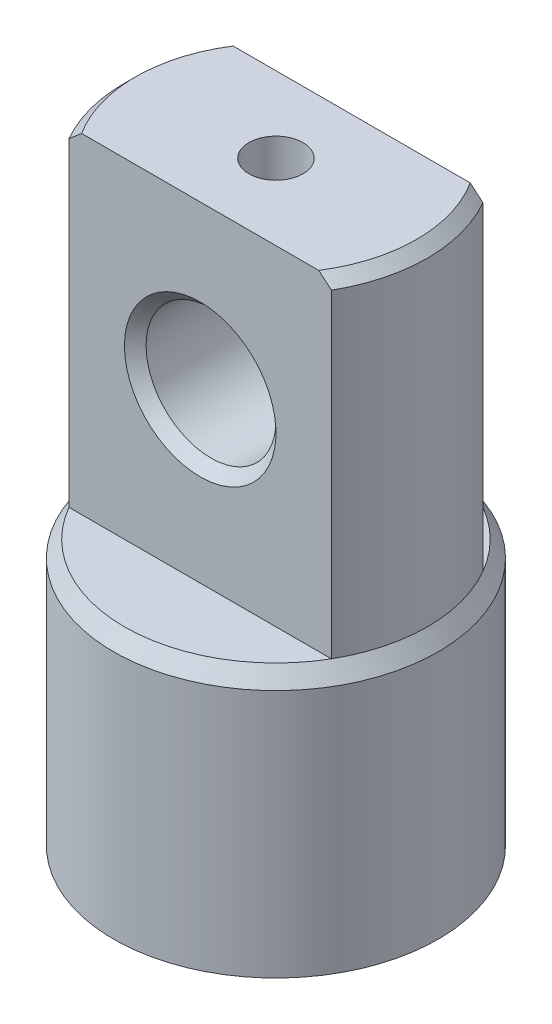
ISO-10303-21;
HEADER;
FILE_DESCRIPTION(('STEP AP214'),'2;1');
FILE_NAME('part.step','',(''),(''),'','','');
FILE_SCHEMA(('AUTOMOTIVE_DESIGN { 1 0 10303 214 1 1 1 1 }'));
ENDSEC;
DATA;
#1=APPLICATION_CONTEXT('core data for automotive mechanical design processes');
#2=APPLICATION_PROTOCOL_DEFINITION('international standard','automotive_design',2000,#1);
#3=PRODUCT_CONTEXT('',#1,'mechanical');
#4=PRODUCT('Part','Part','',(#3));
#5=PRODUCT_RELATED_PRODUCT_CATEGORY('part','',(#4));
#6=PRODUCT_DEFINITION_FORMATION('','',#4);
#7=PRODUCT_DEFINITION_CONTEXT('part definition',#1,'design');
#8=PRODUCT_DEFINITION('design','',#6,#7);
#9=PRODUCT_DEFINITION_SHAPE('','',#8);
#10=(LENGTH_UNIT() NAMED_UNIT(*) SI_UNIT(.MILLI.,.METRE.));
#11=(NAMED_UNIT(*) PLANE_ANGLE_UNIT() SI_UNIT($,.RADIAN.));
#12=(NAMED_UNIT(*) SI_UNIT($,.STERADIAN.) SOLID_ANGLE_UNIT());
#13=UNCERTAINTY_MEASURE_WITH_UNIT(LENGTH_MEASURE(1.E-05),#10,'distance_accuracy_value','');
#14=(GEOMETRIC_REPRESENTATION_CONTEXT(3) GLOBAL_UNCERTAINTY_ASSIGNED_CONTEXT((#13)) GLOBAL_UNIT_ASSIGNED_CONTEXT((#10,
#11,#12)) REPRESENTATION_CONTEXT('',''));
#15=CARTESIAN_POINT('',(0.,0.,0.));
#16=DIRECTION('',(0.,0.,1.));
#17=DIRECTION('',(1.,0.,0.));
#18=AXIS2_PLACEMENT_3D('',#15,#16,#17);
#19=CARTESIAN_POINT('',(-13.2664991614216,24.5,7.));
#20=DIRECTION('',(0.,0.,-1.));
#21=DIRECTION('',(-1.,0.,0.));
#22=AXIS2_PLACEMENT_3D('',#19,#20,#21);
#23=PLANE('',#22);
#24=CARTESIAN_POINT('',(0.,40.,7.));
#25=DIRECTION('',(0.,0.,-1.));
#26=DIRECTION('',(-1.,0.,0.));
#27=AXIS2_PLACEMENT_3D('',#24,#25,#26);
#28=CIRCLE('',#27,7.);
#29=CARTESIAN_POINT('',(-7.,40.,7.));
#30=VERTEX_POINT('',#29);
#31=EDGE_CURVE('E11',#30,#30,#28,.T.);
#32=ORIENTED_EDGE('',*,*,#31,.T.);
#33=EDGE_LOOP('',(#32));
#34=FACE_BOUND('',#33,.T.);
#35=DIRECTION('',(0.,-1.,0.));
#36=VECTOR('',#35,1.);
#37=CARTESIAN_POINT('',(12.1243556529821,0.,7.));
#38=LINE('',#37,#36);
#39=CARTESIAN_POINT('',(12.1243556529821,24.5,7.));
#40=VERTEX_POINT('',#39);
#41=CARTESIAN_POINT('',(12.1243556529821,54.,7.));
#42=VERTEX_POINT('',#41);
#43=EDGE_CURVE('E102',#40,#42,#38,.F.);
#44=ORIENTED_EDGE('',*,*,#43,.T.);
#45=CARTESIAN_POINT('',(12.1243556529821,54.,7.));
#46=CARTESIAN_POINT('',(12.0274031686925,54.0839628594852,7.));
#47=CARTESIAN_POINT('',(11.9303264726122,54.1677824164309,7.));
#48=CARTESIAN_POINT('',(11.7359098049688,54.3351133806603,7.));
#49=CARTESIAN_POINT('',(11.638569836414,54.4186247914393,7.));
#50=CARTESIAN_POINT('',(11.4436094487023,54.5853199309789,7.));
#51=CARTESIAN_POINT('',(11.3459890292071,54.6685036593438,7.));
#52=CARTESIAN_POINT('',(11.1504488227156,54.8345207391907,7.));
#53=CARTESIAN_POINT('',(11.0525290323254,54.917354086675,7.));
#54=CARTESIAN_POINT('',(10.9544511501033,55.,7.));
#55=B_SPLINE_CURVE_WITH_KNOTS('',3,(#45,#46,#47,#48,#49,#50,#51,#52,#53,#54),.UNSPECIFIED.,.F.,
.F.,(4,2,2,2,4),(0.,0.384767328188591,0.769530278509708,1.15429369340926,1.53906148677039),.UNSPECIFIED.);
#56=CARTESIAN_POINT('',(10.9544511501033,55.,7.));
#57=VERTEX_POINT('',#56);
#58=EDGE_CURVE('E179',#42,#57,#55,.T.);
#59=ORIENTED_EDGE('',*,*,#58,.T.);
#60=DIRECTION('',(-1.,0.,0.));
#61=VECTOR('',#60,1.);
#62=CARTESIAN_POINT('',(14.,55.,7.));
#63=LINE('',#62,#61);
#64=CARTESIAN_POINT('',(-10.9544511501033,55.,7.));
#65=VERTEX_POINT('',#64);
#66=EDGE_CURVE('E234',#57,#65,#63,.T.);
#67=ORIENTED_EDGE('',*,*,#66,.T.);
#68=CARTESIAN_POINT('',(-10.9544511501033,55.,7.));
#69=CARTESIAN_POINT('',(-11.0525290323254,54.917354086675,7.));
#70=CARTESIAN_POINT('',(-11.1504488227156,54.8345207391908,7.));
#71=CARTESIAN_POINT('',(-11.3459890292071,54.6685036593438,7.));
#72=CARTESIAN_POINT('',(-11.4436094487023,54.5853199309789,7.));
#73=CARTESIAN_POINT('',(-11.638569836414,54.4186247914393,7.));
#74=CARTESIAN_POINT('',(-11.7359098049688,54.3351133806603,7.));
#75=CARTESIAN_POINT('',(-11.9303264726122,54.1677824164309,7.));
#76=CARTESIAN_POINT('',(-12.0274031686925,54.0839628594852,7.));
#77=CARTESIAN_POINT('',(-12.1243556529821,54.,7.));
#78=B_SPLINE_CURVE_WITH_KNOTS('',3,(#68,#69,#70,#71,#72,#73,#74,#75,#76,#77),.UNSPECIFIED.,.F.,
.F.,(4,2,2,2,4),(0.,0.384767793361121,0.769531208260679,1.15429415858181,1.53906148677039),.UNSPECIFIED.);
#79=CARTESIAN_POINT('',(-12.1243556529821,54.,7.));
#80=VERTEX_POINT('',#79);
#81=EDGE_CURVE('E172',#65,#80,#78,.T.);
#82=ORIENTED_EDGE('',*,*,#81,.T.);
#83=DIRECTION('',(0.,-1.,0.));
#84=VECTOR('',#83,1.);
#85=CARTESIAN_POINT('',(-12.1243556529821,0.,7.));
#86=LINE('',#85,#84);
#87=CARTESIAN_POINT('',(-12.1243556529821,24.5,7.));
#88=VERTEX_POINT('',#87);
#89=EDGE_CURVE('E104',#80,#88,#86,.T.);
#90=ORIENTED_EDGE('',*,*,#89,.T.);
#91=DIRECTION('',(-1.,0.,0.));
#92=VECTOR('',#91,1.);
#93=CARTESIAN_POINT('',(-13.2664991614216,24.5,7.));
#94=LINE('',#93,#92);
#95=EDGE_CURVE('E91',#40,#88,#94,.T.);
#96=ORIENTED_EDGE('',*,*,#95,.F.);
#97=EDGE_LOOP('',(#44,#59,#67,#82,#90,#96));
#98=FACE_BOUND('',#97,.T.);
#99=ADVANCED_FACE('F32',(#34,#98),#23,.F.);
#100=CARTESIAN_POINT('',(0.,0.,0.));
#101=DIRECTION('',(0.,-1.,0.));
#102=DIRECTION('',(0.,0.,-1.));
#103=AXIS2_PLACEMENT_3D('',#100,#101,#102);
#104=CYLINDRICAL_SURFACE('',#103,14.);
#105=DIRECTION('',(0.,-1.,0.));
#106=VECTOR('',#105,1.);
#107=CARTESIAN_POINT('',(12.1243556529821,0.,-7.));
#108=LINE('',#107,#106);
#109=CARTESIAN_POINT('',(12.1243556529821,54.,-7.));
#110=VERTEX_POINT('',#109);
#111=CARTESIAN_POINT('',(12.1243556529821,24.5,-7.));
#112=VERTEX_POINT('',#111);
#113=EDGE_CURVE('E127',#110,#112,#108,.T.);
#114=ORIENTED_EDGE('',*,*,#113,.F.);
#115=CARTESIAN_POINT('',(0.,54.,0.));
#116=DIRECTION('',(0.,1.,0.));
#117=DIRECTION('',(0.,0.,1.));
#118=AXIS2_PLACEMENT_3D('',#115,#116,#117);
#119=CIRCLE('',#118,14.);
#120=EDGE_CURVE('E113',#110,#42,#119,.F.);
#121=ORIENTED_EDGE('',*,*,#120,.T.);
#122=ORIENTED_EDGE('',*,*,#43,.F.);
#123=CARTESIAN_POINT('',(0.,24.5,0.));
#124=DIRECTION('',(0.,-1.,0.));
#125=DIRECTION('',(0.,0.,-1.));
#126=AXIS2_PLACEMENT_3D('',#123,#124,#125);
#127=CIRCLE('',#126,14.);
#128=EDGE_CURVE('E95',#112,#40,#127,.T.);
#129=ORIENTED_EDGE('',*,*,#128,.F.);
#130=EDGE_LOOP('',(#114,#121,#122,#129));
#131=FACE_BOUND('',#130,.T.);
#132=ADVANCED_FACE('F111',(#131),#104,.T.);
#133=CARTESIAN_POINT('',(0.,0.,0.));
#134=DIRECTION('',(0.,-1.,0.));
#135=DIRECTION('',(0.,0.,-1.));
#136=AXIS2_PLACEMENT_3D('',#133,#134,#135);
#137=PLANE('',#136);
#138=CARTESIAN_POINT('',(0.,0.,0.));
#139=DIRECTION('',(0.,-1.,0.));
#140=DIRECTION('',(0.,0.,-1.));
#141=AXIS2_PLACEMENT_3D('',#138,#139,#140);
#142=CIRCLE('',#141,15.);
#143=CARTESIAN_POINT('',(0.,0.,-15.));
#144=VERTEX_POINT('',#143);
#145=EDGE_CURVE('E122',#144,#144,#142,.T.);
#146=ORIENTED_EDGE('',*,*,#145,.T.);
#147=EDGE_LOOP('',(#146));
#148=FACE_BOUND('',#147,.T.);
#149=ADVANCED_FACE('F162',(#148),#137,.T.);
#150=CARTESIAN_POINT('',(0.,0.,0.));
#151=DIRECTION('',(0.,-1.,0.));
#152=DIRECTION('',(0.,0.,-1.));
#153=AXIS2_PLACEMENT_3D('',#150,#151,#152);
#154=CYLINDRICAL_SURFACE('',#153,15.);
#155=CARTESIAN_POINT('',(0.,23.,0.));
#156=DIRECTION('',(0.,-1.,0.));
#157=DIRECTION('',(0.,0.,-1.));
#158=AXIS2_PLACEMENT_3D('',#155,#156,#157);
#159=CIRCLE('',#158,15.);
#160=CARTESIAN_POINT('',(0.,23.,-15.));
#161=VERTEX_POINT('',#160);
#162=EDGE_CURVE('E120',#161,#161,#159,.T.);
#163=ORIENTED_EDGE('',*,*,#162,.T.);
#164=EDGE_LOOP('',(#163));
#165=FACE_BOUND('',#164,.T.);
#166=ORIENTED_EDGE('',*,*,#145,.F.);
#167=EDGE_LOOP('',(#166));
#168=FACE_BOUND('',#167,.T.);
#169=ADVANCED_FACE('F221',(#165,#168),#154,.T.);
#170=CARTESIAN_POINT('',(0.,23.,0.));
#171=DIRECTION('',(0.,-1.,0.));
#172=DIRECTION('',(0.,0.,-1.));
#173=AXIS2_PLACEMENT_3D('',#170,#171,#172);
#174=CONICAL_SURFACE('',#173,15.,0.588002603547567);
#175=ORIENTED_EDGE('',*,*,#128,.T.);
#176=EDGE_CURVE('E88',#40,#88,#127,.T.);
#177=ORIENTED_EDGE('',*,*,#176,.T.);
#178=CARTESIAN_POINT('',(-12.1243556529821,24.5,-7.));
#179=VERTEX_POINT('',#178);
#180=EDGE_CURVE('E96',#88,#179,#127,.T.);
#181=ORIENTED_EDGE('',*,*,#180,.T.);
#182=EDGE_CURVE('E98',#179,#112,#127,.T.);
#183=ORIENTED_EDGE('',*,*,#182,.T.);
#184=EDGE_LOOP('',(#175,#177,#181,#183));
#185=FACE_BOUND('',#184,.T.);
#186=ORIENTED_EDGE('',*,*,#162,.F.);
#187=EDGE_LOOP('',(#186));
#188=FACE_BOUND('',#187,.T.);
#189=ADVANCED_FACE('F117',(#185,#188),#174,.T.);
#190=ORIENTED_EDGE('',*,*,#89,.F.);
#191=CARTESIAN_POINT('',(0.,54.,0.));
#192=DIRECTION('',(0.,1.,0.));
#193=DIRECTION('',(0.,0.,1.));
#194=AXIS2_PLACEMENT_3D('',#191,#192,#193);
#195=CIRCLE('',#194,14.);
#196=CARTESIAN_POINT('',(-12.1243556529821,54.,-7.));
#197=VERTEX_POINT('',#196);
#198=EDGE_CURVE('E203',#80,#197,#195,.F.);
#199=ORIENTED_EDGE('',*,*,#198,.T.);
#200=DIRECTION('',(0.,-1.,0.));
#201=VECTOR('',#200,1.);
#202=CARTESIAN_POINT('',(-12.1243556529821,0.,-7.));
#203=LINE('',#202,#201);
#204=EDGE_CURVE('E125',#179,#197,#203,.F.);
#205=ORIENTED_EDGE('',*,*,#204,.F.);
#206=ORIENTED_EDGE('',*,*,#180,.F.);
#207=EDGE_LOOP('',(#190,#199,#205,#206));
#208=FACE_BOUND('',#207,.T.);
#209=ADVANCED_FACE('F164',(#208),#104,.T.);
#210=CARTESIAN_POINT('',(14.,55.,0.));
#211=DIRECTION('',(0.,1.,0.));
#212=DIRECTION('',(0.,0.,1.));
#213=AXIS2_PLACEMENT_3D('',#210,#211,#212);
#214=PLANE('',#213);
#215=CARTESIAN_POINT('',(0.,55.,0.));
#216=DIRECTION('',(0.,1.,0.));
#217=DIRECTION('',(0.,0.,1.));
#218=AXIS2_PLACEMENT_3D('',#215,#216,#217);
#219=CIRCLE('',#218,2.49999999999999);
#220=CARTESIAN_POINT('',(0.,55.,2.49999999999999));
#221=VERTEX_POINT('',#220);
#222=EDGE_CURVE('E142',#221,#221,#219,.T.);
#223=ORIENTED_EDGE('',*,*,#222,.F.);
#224=EDGE_LOOP('',(#223));
#225=FACE_BOUND('',#224,.T.);
#226=ORIENTED_EDGE('',*,*,#66,.F.);
#227=CARTESIAN_POINT('',(0.,55.,0.));
#228=DIRECTION('',(0.,1.,0.));
#229=DIRECTION('',(0.,0.,1.));
#230=AXIS2_PLACEMENT_3D('',#227,#228,#229);
#231=CIRCLE('',#230,13.);
#232=CARTESIAN_POINT('',(10.9544511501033,55.,-7.));
#233=VERTEX_POINT('',#232);
#234=EDGE_CURVE('E55',#57,#233,#231,.T.);
#235=ORIENTED_EDGE('',*,*,#234,.T.);
#236=DIRECTION('',(1.,0.,0.));
#237=VECTOR('',#236,1.);
#238=CARTESIAN_POINT('',(14.,55.,-7.));
#239=LINE('',#238,#237);
#240=CARTESIAN_POINT('',(-10.9544511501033,55.,-7.));
#241=VERTEX_POINT('',#240);
#242=EDGE_CURVE('E232',#241,#233,#239,.T.);
#243=ORIENTED_EDGE('',*,*,#242,.F.);
#244=CARTESIAN_POINT('',(0.,55.,0.));
#245=DIRECTION('',(0.,1.,0.));
#246=DIRECTION('',(0.,0.,1.));
#247=AXIS2_PLACEMENT_3D('',#244,#245,#246);
#248=CIRCLE('',#247,13.);
#249=EDGE_CURVE('E185',#241,#65,#248,.T.);
#250=ORIENTED_EDGE('',*,*,#249,.T.);
#251=EDGE_LOOP('',(#226,#235,#243,#250));
#252=FACE_BOUND('',#251,.T.);
#253=ADVANCED_FACE('F212',(#225,#252),#214,.T.);
#254=CARTESIAN_POINT('',(-13.2664991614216,24.5,-7.));
#255=DIRECTION('',(0.,0.,1.));
#256=DIRECTION('',(1.,0.,0.));
#257=AXIS2_PLACEMENT_3D('',#254,#255,#256);
#258=PLANE('',#257);
#259=CARTESIAN_POINT('',(0.,40.,-7.));
#260=DIRECTION('',(0.,0.,1.));
#261=DIRECTION('',(1.,0.,0.));
#262=AXIS2_PLACEMENT_3D('',#259,#260,#261);
#263=CIRCLE('',#262,6.99999999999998);
#264=CARTESIAN_POINT('',(6.99999999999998,40.,-7.));
#265=VERTEX_POINT('',#264);
#266=EDGE_CURVE('E239',#265,#265,#263,.T.);
#267=ORIENTED_EDGE('',*,*,#266,.T.);
#268=EDGE_LOOP('',(#267));
#269=FACE_BOUND('',#268,.T.);
#270=ORIENTED_EDGE('',*,*,#242,.T.);
#271=CARTESIAN_POINT('',(10.9544511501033,55.,-7.));
#272=CARTESIAN_POINT('',(11.0525290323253,54.917354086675,-7.));
#273=CARTESIAN_POINT('',(11.1504488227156,54.8345207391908,-7.));
#274=CARTESIAN_POINT('',(11.3459890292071,54.6685036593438,-7.));
#275=CARTESIAN_POINT('',(11.4436094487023,54.5853199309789,-7.));
#276=CARTESIAN_POINT('',(11.638569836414,54.4186247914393,-7.));
#277=CARTESIAN_POINT('',(11.7359098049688,54.3351133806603,-7.));
#278=CARTESIAN_POINT('',(11.9303264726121,54.1677824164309,-7.));
#279=CARTESIAN_POINT('',(12.0274031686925,54.0839628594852,-7.));
#280=CARTESIAN_POINT('',(12.1243556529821,54.,-7.));
#281=B_SPLINE_CURVE_WITH_KNOTS('',3,(#271,#272,#273,#274,#275,#276,#277,#278,#279,#280),
.UNSPECIFIED.,.F.,.F.,(4,2,2,2,4),(0.,0.384767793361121,0.769531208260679,1.15429415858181,
1.53906148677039),.UNSPECIFIED.);
#282=EDGE_CURVE('E197',#233,#110,#281,.T.);
#283=ORIENTED_EDGE('',*,*,#282,.T.);
#284=ORIENTED_EDGE('',*,*,#113,.T.);
#285=DIRECTION('',(1.,0.,0.));
#286=VECTOR('',#285,1.);
#287=CARTESIAN_POINT('',(-13.2664991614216,24.5,-7.));
#288=LINE('',#287,#286);
#289=EDGE_CURVE('E114',#179,#112,#288,.T.);
#290=ORIENTED_EDGE('',*,*,#289,.F.);
#291=ORIENTED_EDGE('',*,*,#204,.T.);
#292=CARTESIAN_POINT('',(-12.1243556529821,54.,-7.));
#293=CARTESIAN_POINT('',(-12.0274031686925,54.0839628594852,-7.));
#294=CARTESIAN_POINT('',(-11.9303264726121,54.1677824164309,-7.));
#295=CARTESIAN_POINT('',(-11.7359098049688,54.3351133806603,-7.));
#296=CARTESIAN_POINT('',(-11.638569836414,54.4186247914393,-7.));
#297=CARTESIAN_POINT('',(-11.4436094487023,54.5853199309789,-7.));
#298=CARTESIAN_POINT('',(-11.3459890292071,54.6685036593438,-7.));
#299=CARTESIAN_POINT('',(-11.1504488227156,54.8345207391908,-7.));
#300=CARTESIAN_POINT('',(-11.0525290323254,54.917354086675,-7.));
#301=CARTESIAN_POINT('',(-10.9544511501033,55.,-7.));
#302=B_SPLINE_CURVE_WITH_KNOTS('',3,(#292,#293,#294,#295,#296,#297,#298,#299,#300,#301),
.UNSPECIFIED.,.F.,.F.,(4,2,2,2,4),(0.,0.384767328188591,0.769530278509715,1.15429369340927,
1.53906148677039),.UNSPECIFIED.);
#303=EDGE_CURVE('E47',#197,#241,#302,.T.);
#304=ORIENTED_EDGE('',*,*,#303,.T.);
#305=EDGE_LOOP('',(#270,#283,#284,#290,#291,#304));
#306=FACE_BOUND('',#305,.T.);
#307=ADVANCED_FACE('F208',(#269,#306),#258,.F.);
#308=CARTESIAN_POINT('',(0.,24.5,0.));
#309=DIRECTION('',(0.,1.,0.));
#310=DIRECTION('',(0.,0.,1.));
#311=AXIS2_PLACEMENT_3D('',#308,#309,#310);
#312=PLANE('',#311);
#313=ORIENTED_EDGE('',*,*,#289,.T.);
#314=ORIENTED_EDGE('',*,*,#182,.F.);
#315=EDGE_LOOP('',(#313,#314));
#316=FACE_BOUND('',#315,.T.);
#317=ADVANCED_FACE('F168',(#316),#312,.T.);
#318=CARTESIAN_POINT('',(0.,24.5,0.));
#319=DIRECTION('',(0.,1.,0.));
#320=DIRECTION('',(0.,0.,1.));
#321=AXIS2_PLACEMENT_3D('',#318,#319,#320);
#322=PLANE('',#321);
#323=ORIENTED_EDGE('',*,*,#95,.T.);
#324=ORIENTED_EDGE('',*,*,#176,.F.);
#325=EDGE_LOOP('',(#323,#324));
#326=FACE_BOUND('',#325,.T.);
#327=ADVANCED_FACE('F90',(#326),#322,.T.);
#328=CARTESIAN_POINT('',(0.,54.,0.));
#329=DIRECTION('',(0.,-1.,0.));
#330=DIRECTION('',(0.,0.,-1.));
#331=AXIS2_PLACEMENT_3D('',#328,#329,#330);
#332=CONICAL_SURFACE('',#331,14.,0.785398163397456);
#333=ORIENTED_EDGE('',*,*,#282,.F.);
#334=ORIENTED_EDGE('',*,*,#234,.F.);
#335=ORIENTED_EDGE('',*,*,#58,.F.);
#336=ORIENTED_EDGE('',*,*,#120,.F.);
#337=EDGE_LOOP('',(#333,#334,#335,#336));
#338=FACE_BOUND('',#337,.T.);
#339=ADVANCED_FACE('F187',(#338),#332,.T.);
#340=CARTESIAN_POINT('',(0.,54.,0.));
#341=DIRECTION('',(0.,-1.,0.));
#342=DIRECTION('',(0.,0.,-1.));
#343=AXIS2_PLACEMENT_3D('',#340,#341,#342);
#344=CONICAL_SURFACE('',#343,14.,0.785398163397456);
#345=ORIENTED_EDGE('',*,*,#81,.F.);
#346=ORIENTED_EDGE('',*,*,#249,.F.);
#347=ORIENTED_EDGE('',*,*,#303,.F.);
#348=ORIENTED_EDGE('',*,*,#198,.F.);
#349=EDGE_LOOP('',(#345,#346,#347,#348));
#350=FACE_BOUND('',#349,.T.);
#351=ADVANCED_FACE('F191',(#350),#344,.T.);
#352=CARTESIAN_POINT('',(0.,40.,7.));
#353=DIRECTION('',(0.,0.,1.));
#354=DIRECTION('',(1.,0.,0.));
#355=AXIS2_PLACEMENT_3D('',#352,#353,#354);
#356=CYLINDRICAL_SURFACE('',#355,5.99999999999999);
#357=CARTESIAN_POINT('',(0.,46.,2.49999999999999));
#358=CARTESIAN_POINT('',(0.13390391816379,45.9999962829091,2.49999528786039));
#359=CARTESIAN_POINT('',(0.268039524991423,45.9954665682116,2.48917868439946));
#360=CARTESIAN_POINT('',(0.532498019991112,45.9778011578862,2.44631926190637));
#361=CARTESIAN_POINT('',(0.662810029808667,45.9646430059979,2.41422105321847));
#362=CARTESIAN_POINT('',(0.915376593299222,45.9311262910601,2.33017851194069));
#363=CARTESIAN_POINT('',(1.03765681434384,45.9107921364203,2.2783014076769));
#364=CARTESIAN_POINT('',(1.27165974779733,45.8649055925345,2.15645416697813));
#365=CARTESIAN_POINT('',(1.38338564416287,45.8393547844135,2.08648951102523));
#366=CARTESIAN_POINT('',(1.59889674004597,45.7841566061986,1.92674208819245));
#367=CARTESIAN_POINT('',(1.70208251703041,45.7543750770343,1.83619739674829));
#368=CARTESIAN_POINT('',(1.89231966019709,45.6946542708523,1.63947131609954));
#369=CARTESIAN_POINT('',(1.97936253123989,45.6647149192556,1.53328174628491));
#370=CARTESIAN_POINT('',(2.13907474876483,45.6064204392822,1.30194644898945));
#371=CARTESIAN_POINT('',(2.2108261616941,45.578215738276,1.17612510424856));
#372=CARTESIAN_POINT('',(2.33187881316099,45.5287114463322,0.912853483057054));
#373=CARTESIAN_POINT('',(2.38119161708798,45.507408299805,0.775409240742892));
#374=CARTESIAN_POINT('',(2.45349196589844,45.4755711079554,0.499692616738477));
#375=CARTESIAN_POINT('',(2.47763315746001,45.4645677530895,0.36177903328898));
#376=CARTESIAN_POINT('',(2.50250419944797,45.4532265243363,0.0834534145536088));
#377=CARTESIAN_POINT('',(2.50324696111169,45.4528827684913,-0.05695720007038));
#378=CARTESIAN_POINT('',(2.48216900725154,45.4625023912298,-0.324800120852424));
#379=CARTESIAN_POINT('',(2.46207362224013,45.4716776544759,-0.452402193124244));
#380=CARTESIAN_POINT('',(2.40278382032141,45.4979696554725,-0.70222418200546));
#381=CARTESIAN_POINT('',(2.36358574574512,45.5150879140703,-0.824443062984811));
#382=CARTESIAN_POINT('',(2.26643917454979,45.5557236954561,-1.06311540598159));
#383=CARTESIAN_POINT('',(2.20810943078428,45.579369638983,-1.17939084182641));
#384=CARTESIAN_POINT('',(2.07462485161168,45.6303666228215,-1.40095546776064));
#385=CARTESIAN_POINT('',(1.99946338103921,45.6577191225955,-1.50624030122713));
#386=CARTESIAN_POINT('',(1.82699193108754,45.7158595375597,-1.71219991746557));
#387=CARTESIAN_POINT('',(1.72834696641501,45.7467424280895,-1.81173313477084));
#388=CARTESIAN_POINT('',(1.51545918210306,45.8065134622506,-1.99322700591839));
#389=CARTESIAN_POINT('',(1.40121271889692,45.8354011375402,-2.07518354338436));
#390=CARTESIAN_POINT('',(1.15689589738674,45.8887656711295,-2.22087164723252));
#391=CARTESIAN_POINT('',(1.02652116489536,45.9131253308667,-2.28413889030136));
#392=CARTESIAN_POINT('',(0.755704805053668,45.9537896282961,-2.38744227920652));
#393=CARTESIAN_POINT('',(0.615268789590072,45.970098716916,-2.42749126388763));
#394=CARTESIAN_POINT('',(0.337856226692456,45.9919928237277,-2.48083198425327));
#395=CARTESIAN_POINT('',(0.201222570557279,45.9981908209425,-2.49565571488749));
#396=CARTESIAN_POINT('',(-0.0727093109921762,46.0011210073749,-2.50269244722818));
#397=CARTESIAN_POINT('',(-0.210007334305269,45.9978559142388,-2.49491194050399));
#398=CARTESIAN_POINT('',(-0.474196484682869,45.9826243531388,-2.45805783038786));
#399=CARTESIAN_POINT('',(-0.601265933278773,45.9710977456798,-2.4300600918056));
#400=CARTESIAN_POINT('',(-0.848765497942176,45.9409721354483,-2.35506361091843));
#401=CARTESIAN_POINT('',(-0.96919477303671,45.9223722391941,-2.30806246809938));
#402=CARTESIAN_POINT('',(-1.20421799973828,45.8791654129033,-2.19485804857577));
#403=CARTESIAN_POINT('',(-1.31851447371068,45.8543898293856,-2.12810363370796));
#404=CARTESIAN_POINT('',(-1.53469243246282,45.8014760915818,-1.97789324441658));
#405=CARTESIAN_POINT('',(-1.63656870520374,45.7733365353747,-1.89443029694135));
#406=CARTESIAN_POINT('',(-1.83266686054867,45.7142417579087,-1.70619353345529));
#407=CARTESIAN_POINT('',(-1.92582139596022,45.6832290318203,-1.60032299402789));
#408=CARTESIAN_POINT('',(-2.09333969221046,45.6236867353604,-1.3739574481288));
#409=CARTESIAN_POINT('',(-2.16769918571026,45.5951577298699,-1.25345912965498));
#410=CARTESIAN_POINT('',(-2.29631920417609,45.5436277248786,-0.99877164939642));
#411=CARTESIAN_POINT('',(-2.3502783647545,45.520711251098,-0.864411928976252));
#412=CARTESIAN_POINT('',(-2.43434827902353,45.4841671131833,-0.587258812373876));
#413=CARTESIAN_POINT('',(-2.46447869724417,45.4705317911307,-0.444472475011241));
#414=CARTESIAN_POINT('',(-2.49808160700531,45.4552632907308,-0.166362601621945));
#415=CARTESIAN_POINT('',(-2.50342760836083,45.4527870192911,-0.0313106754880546));
#416=CARTESIAN_POINT('',(-2.49231151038,45.4578770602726,0.237685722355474));
#417=CARTESIAN_POINT('',(-2.47585275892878,45.4654418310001,0.371630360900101));
#418=CARTESIAN_POINT('',(-2.42316809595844,45.4889910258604,0.62818549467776));
#419=CARTESIAN_POINT('',(-2.38789807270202,45.5045670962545,0.75103334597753));
#420=CARTESIAN_POINT('',(-2.29952656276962,45.542063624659,0.989096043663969));
#421=CARTESIAN_POINT('',(-2.24642006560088,45.5639858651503,1.104308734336));
#422=CARTESIAN_POINT('',(-2.12020572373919,45.6133390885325,1.33139178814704));
#423=CARTESIAN_POINT('',(-2.04608723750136,45.6410220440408,1.44264464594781));
#424=CARTESIAN_POINT('',(-1.88136812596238,45.6980737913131,1.65172029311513));
#425=CARTESIAN_POINT('',(-1.79076178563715,45.7274431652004,1.74953840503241));
#426=CARTESIAN_POINT('',(-1.58780416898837,45.7871278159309,1.93629730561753));
#427=CARTESIAN_POINT('',(-1.47434977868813,45.8173561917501,2.0240726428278));
#428=CARTESIAN_POINT('',(-1.23319985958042,45.8732030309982,2.1793991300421));
#429=CARTESIAN_POINT('',(-1.10549787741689,45.8988193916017,2.24694106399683));
#430=CARTESIAN_POINT('',(-0.84146521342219,45.9421830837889,2.3584188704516));
#431=CARTESIAN_POINT('',(-0.705312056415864,45.9600534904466,2.40272649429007));
#432=CARTESIAN_POINT('',(-0.426816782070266,45.9864223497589,2.46741568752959));
#433=CARTESIAN_POINT('',(-0.284495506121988,45.9949501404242,2.4878721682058));
#434=CARTESIAN_POINT('',(-0.118052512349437,45.9988856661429,2.49732384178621));
#435=CARTESIAN_POINT('',(-0.0944569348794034,45.99930292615,2.49832660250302));
#436=CARTESIAN_POINT('',(-0.0472433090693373,45.9998604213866,2.49966509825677));
#437=CARTESIAN_POINT('',(-0.0236252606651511,46.0000006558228,2.50000083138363));
#438=CARTESIAN_POINT('',(0.,46.,2.49999999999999));
#439=B_SPLINE_CURVE_WITH_KNOTS('',3,(#357,#358,#359,#360,#361,#362,#363,#364,#365,#366,#367,
#368,#369,#370,#371,#372,#373,#374,#375,#376,#377,#378,#379,#380,#381,#382,#383,#384,#385,#386,
#387,#388,#389,#390,#391,#392,#393,#394,#395,#396,#397,#398,#399,#400,#401,#402,#403,#404,#405,
#406,#407,#408,#409,#410,#411,#412,#413,#414,#415,#416,#417,#418,#419,#420,#421,#422,#423,#424,
#425,#426,#427,#428,#429,#430,#431,#432,#433,#434,#435,#436,#437,#438),.UNSPECIFIED.,.T.,.F.,(4,
2,2,2,2,2,2,2,2,2,2,2,2,2,2,2,2,2,2,2,2,2,2,2,2,2,2,2,2,2,2,2,2,2,2,2,2,2,2,2,4),(0.,
0.401613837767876,0.804277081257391,1.2055837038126,1.60676887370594,2.02635872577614,
2.4461687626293,2.8866344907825,3.32687293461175,3.74590546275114,4.16470676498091,
4.55140314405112,4.93817359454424,5.33317426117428,5.72833091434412,6.15688282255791,
6.58553498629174,7.02408110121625,7.46238448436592,7.872968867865,8.28343534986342,
8.67353179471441,9.06367753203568,9.4659427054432,9.86837610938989,10.2995697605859,
10.7308612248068,11.1682957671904,11.6053689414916,12.0087975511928,12.4121642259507,
12.7967529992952,13.1814498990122,13.5892778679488,13.9972474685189,14.4349307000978,
14.8728129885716,15.3034571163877,15.7327450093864,15.8036033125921,15.8744618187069),.UNSPECIFIED.);
#440=CARTESIAN_POINT('',(0.,46.,2.49999999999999));
#441=VERTEX_POINT('',#440);
#442=EDGE_CURVE('E105',#441,#441,#439,.T.);
#443=ORIENTED_EDGE('',*,*,#442,.T.);
#444=EDGE_LOOP('',(#443));
#445=FACE_BOUND('',#444,.T.);
#446=CARTESIAN_POINT('',(0.,40.,-6.00000000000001));
#447=DIRECTION('',(0.,0.,1.));
#448=DIRECTION('',(1.,0.,0.));
#449=AXIS2_PLACEMENT_3D('',#446,#447,#448);
#450=CIRCLE('',#449,5.99999999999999);
#451=CARTESIAN_POINT('',(5.99999999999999,40.,-6.00000000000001));
#452=VERTEX_POINT('',#451);
#453=EDGE_CURVE('E40',#452,#452,#450,.F.);
#454=ORIENTED_EDGE('',*,*,#453,.T.);
#455=EDGE_LOOP('',(#454));
#456=FACE_BOUND('',#455,.T.);
#457=CARTESIAN_POINT('',(0.,40.,6.));
#458=DIRECTION('',(0.,0.,-1.));
#459=DIRECTION('',(-1.,0.,0.));
#460=AXIS2_PLACEMENT_3D('',#457,#458,#459);
#461=CIRCLE('',#460,5.99999999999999);
#462=CARTESIAN_POINT('',(-5.99999999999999,40.,6.));
#463=VERTEX_POINT('',#462);
#464=EDGE_CURVE('E241',#463,#463,#461,.F.);
#465=ORIENTED_EDGE('',*,*,#464,.T.);
#466=EDGE_LOOP('',(#465));
#467=FACE_BOUND('',#466,.T.);
#468=ADVANCED_FACE('F248',(#445,#456,#467),#356,.F.);
#469=CARTESIAN_POINT('',(0.,40.,-7.));
#470=DIRECTION('',(0.,0.,-1.));
#471=DIRECTION('',(-1.,0.,0.));
#472=AXIS2_PLACEMENT_3D('',#469,#470,#471);
#473=CONICAL_SURFACE('',#472,6.99999999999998,0.785398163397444);
#474=ORIENTED_EDGE('',*,*,#453,.F.);
#475=EDGE_LOOP('',(#474));
#476=FACE_BOUND('',#475,.T.);
#477=ORIENTED_EDGE('',*,*,#266,.F.);
#478=EDGE_LOOP('',(#477));
#479=FACE_BOUND('',#478,.T.);
#480=ADVANCED_FACE('F152',(#476,#479),#473,.F.);
#481=CARTESIAN_POINT('',(0.,40.,6.));
#482=DIRECTION('',(0.,0.,1.));
#483=DIRECTION('',(1.,0.,0.));
#484=AXIS2_PLACEMENT_3D('',#481,#482,#483);
#485=CONICAL_SURFACE('',#484,5.99999999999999,0.785398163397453);
#486=ORIENTED_EDGE('',*,*,#31,.F.);
#487=EDGE_LOOP('',(#486));
#488=FACE_BOUND('',#487,.T.);
#489=ORIENTED_EDGE('',*,*,#464,.F.);
#490=EDGE_LOOP('',(#489));
#491=FACE_BOUND('',#490,.T.);
#492=ADVANCED_FACE('F34',(#488,#491),#485,.F.);
#493=CARTESIAN_POINT('',(0.,55.,0.));
#494=DIRECTION('',(0.,1.,0.));
#495=DIRECTION('',(0.,0.,1.));
#496=AXIS2_PLACEMENT_3D('',#493,#494,#495);
#497=CYLINDRICAL_SURFACE('',#496,2.49999999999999);
#498=ORIENTED_EDGE('',*,*,#442,.F.);
#499=EDGE_LOOP('',(#498));
#500=FACE_BOUND('',#499,.T.);
#501=ORIENTED_EDGE('',*,*,#222,.T.);
#502=EDGE_LOOP('',(#501));
#503=FACE_BOUND('',#502,.T.);
#504=ADVANCED_FACE('F145',(#500,#503),#497,.F.);
#505=CLOSED_SHELL('',(#99,#132,#149,#169,#189,#209,#253,#307,#317,#327,#339,#351,#468,#480,#492,#504));
#506=MANIFOLD_SOLID_BREP('B2',#505);
#507=ADVANCED_BREP_SHAPE_REPRESENTATION('',(#18,#506),#14);
#508=SHAPE_DEFINITION_REPRESENTATION(#9,#507);
ENDSEC;
END-ISO-10303-21;
